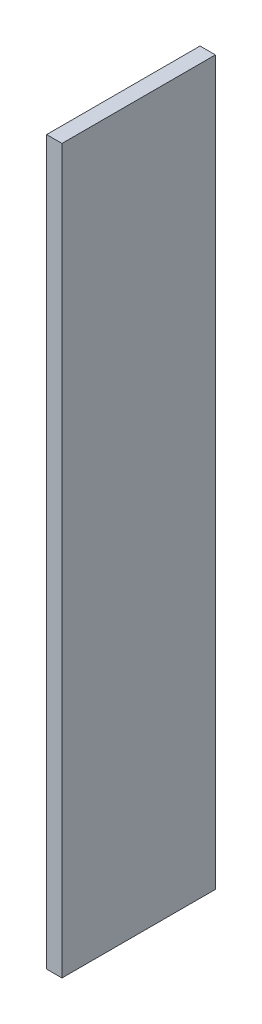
ISO-10303-21;
HEADER;
FILE_DESCRIPTION(('STEP AP214'),'2;1');
FILE_NAME('part.step','',(''),(''),'','','');
FILE_SCHEMA(('AUTOMOTIVE_DESIGN { 1 0 10303 214 1 1 1 1 }'));
ENDSEC;
DATA;
#1=APPLICATION_CONTEXT('core data for automotive mechanical design processes');
#2=APPLICATION_PROTOCOL_DEFINITION('international standard','automotive_design',2000,#1);
#3=PRODUCT_CONTEXT('',#1,'mechanical');
#4=PRODUCT('Part','Part','',(#3));
#5=PRODUCT_RELATED_PRODUCT_CATEGORY('part','',(#4));
#6=PRODUCT_DEFINITION_FORMATION('','',#4);
#7=PRODUCT_DEFINITION_CONTEXT('part definition',#1,'design');
#8=PRODUCT_DEFINITION('design','',#6,#7);
#9=PRODUCT_DEFINITION_SHAPE('','',#8);
#10=(LENGTH_UNIT() NAMED_UNIT(*) SI_UNIT(.MILLI.,.METRE.));
#11=(NAMED_UNIT(*) PLANE_ANGLE_UNIT() SI_UNIT($,.RADIAN.));
#12=(NAMED_UNIT(*) SI_UNIT($,.STERADIAN.) SOLID_ANGLE_UNIT());
#13=UNCERTAINTY_MEASURE_WITH_UNIT(LENGTH_MEASURE(1.E-05),#10,'distance_accuracy_value','');
#14=(GEOMETRIC_REPRESENTATION_CONTEXT(3) GLOBAL_UNCERTAINTY_ASSIGNED_CONTEXT((#13)) GLOBAL_UNIT_ASSIGNED_CONTEXT((#10,
#11,#12)) REPRESENTATION_CONTEXT('',''));
#15=CARTESIAN_POINT('',(0.,0.,0.));
#16=DIRECTION('',(0.,0.,1.));
#17=DIRECTION('',(1.,0.,0.));
#18=AXIS2_PLACEMENT_3D('',#15,#16,#17);
#19=CARTESIAN_POINT('',(35.,235.553999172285,0.));
#20=DIRECTION('',(0.,0.,1.));
#21=DIRECTION('',(1.,0.,0.));
#22=AXIS2_PLACEMENT_3D('',#19,#20,#21);
#23=PLANE('',#22);
#24=DIRECTION('',(1.,0.,0.));
#25=VECTOR('',#24,1.);
#26=CARTESIAN_POINT('',(35.,235.553999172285,0.));
#27=LINE('',#26,#25);
#28=CARTESIAN_POINT('',(35.,235.553999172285,0.));
#29=VERTEX_POINT('',#28);
#30=CARTESIAN_POINT('',(40.,235.553999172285,0.));
#31=VERTEX_POINT('',#30);
#32=EDGE_CURVE('E784',#29,#31,#27,.T.);
#33=ORIENTED_EDGE('',*,*,#32,.T.);
#34=DIRECTION('',(0.,-1.,0.));
#35=VECTOR('',#34,1.);
#36=CARTESIAN_POINT('',(40.,235.553999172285,0.));
#37=LINE('',#36,#35);
#38=CARTESIAN_POINT('',(40.,0.,0.));
#39=VERTEX_POINT('',#38);
#40=EDGE_CURVE('E758',#31,#39,#37,.T.);
#41=ORIENTED_EDGE('',*,*,#40,.T.);
#42=DIRECTION('',(1.,0.,0.));
#43=VECTOR('',#42,1.);
#44=CARTESIAN_POINT('',(35.,0.,0.));
#45=LINE('',#44,#43);
#46=CARTESIAN_POINT('',(35.,0.,0.));
#47=VERTEX_POINT('',#46);
#48=EDGE_CURVE('E370',#47,#39,#45,.T.);
#49=ORIENTED_EDGE('',*,*,#48,.F.);
#50=DIRECTION('',(0.,-1.,0.));
#51=VECTOR('',#50,1.);
#52=CARTESIAN_POINT('',(35.,235.553999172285,0.));
#53=LINE('',#52,#51);
#54=EDGE_CURVE('E775',#29,#47,#53,.T.);
#55=ORIENTED_EDGE('',*,*,#54,.F.);
#56=EDGE_LOOP('',(#33,#41,#49,#55));
#57=FACE_BOUND('',#56,.T.);
#58=ADVANCED_FACE('F363',(#57),#23,.F.);
#59=CARTESIAN_POINT('',(35.,0.,0.));
#60=DIRECTION('',(0.,1.,0.));
#61=DIRECTION('',(-1.,0.,0.));
#62=AXIS2_PLACEMENT_3D('',#59,#60,#61);
#63=PLANE('',#62);
#64=ORIENTED_EDGE('',*,*,#48,.T.);
#65=DIRECTION('',(0.,0.,1.));
#66=VECTOR('',#65,1.);
#67=CARTESIAN_POINT('',(40.,0.,0.));
#68=LINE('',#67,#66);
#69=CARTESIAN_POINT('',(40.,0.,50.));
#70=VERTEX_POINT('',#69);
#71=EDGE_CURVE('E766',#39,#70,#68,.T.);
#72=ORIENTED_EDGE('',*,*,#71,.T.);
#73=DIRECTION('',(1.,0.,0.));
#74=VECTOR('',#73,1.);
#75=CARTESIAN_POINT('',(35.,0.,50.));
#76=LINE('',#75,#74);
#77=CARTESIAN_POINT('',(35.,0.,50.));
#78=VERTEX_POINT('',#77);
#79=EDGE_CURVE('E788',#78,#70,#76,.T.);
#80=ORIENTED_EDGE('',*,*,#79,.F.);
#81=DIRECTION('',(0.,0.,1.));
#82=VECTOR('',#81,1.);
#83=CARTESIAN_POINT('',(35.,0.,0.));
#84=LINE('',#83,#82);
#85=EDGE_CURVE('E778',#47,#78,#84,.T.);
#86=ORIENTED_EDGE('',*,*,#85,.F.);
#87=EDGE_LOOP('',(#64,#72,#80,#86));
#88=FACE_BOUND('',#87,.T.);
#89=ADVANCED_FACE('F792',(#88),#63,.F.);
#90=CARTESIAN_POINT('',(35.,0.,50.));
#91=DIRECTION('',(0.,0.,-1.));
#92=DIRECTION('',(-1.,0.,0.));
#93=AXIS2_PLACEMENT_3D('',#90,#91,#92);
#94=PLANE('',#93);
#95=ORIENTED_EDGE('',*,*,#79,.T.);
#96=DIRECTION('',(0.,1.,0.));
#97=VECTOR('',#96,1.);
#98=CARTESIAN_POINT('',(40.,0.,50.));
#99=LINE('',#98,#97);
#100=CARTESIAN_POINT('',(40.,235.553999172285,50.));
#101=VERTEX_POINT('',#100);
#102=EDGE_CURVE('E769',#70,#101,#99,.T.);
#103=ORIENTED_EDGE('',*,*,#102,.T.);
#104=DIRECTION('',(1.,0.,0.));
#105=VECTOR('',#104,1.);
#106=CARTESIAN_POINT('',(35.,235.553999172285,50.));
#107=LINE('',#106,#105);
#108=CARTESIAN_POINT('',(35.,235.553999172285,50.));
#109=VERTEX_POINT('',#108);
#110=EDGE_CURVE('E786',#109,#101,#107,.T.);
#111=ORIENTED_EDGE('',*,*,#110,.F.);
#112=DIRECTION('',(0.,1.,0.));
#113=VECTOR('',#112,1.);
#114=CARTESIAN_POINT('',(35.,0.,50.));
#115=LINE('',#114,#113);
#116=EDGE_CURVE('E780',#78,#109,#115,.T.);
#117=ORIENTED_EDGE('',*,*,#116,.F.);
#118=EDGE_LOOP('',(#95,#103,#111,#117));
#119=FACE_BOUND('',#118,.T.);
#120=ADVANCED_FACE('F808',(#119),#94,.F.);
#121=CARTESIAN_POINT('',(35.,235.553999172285,50.));
#122=DIRECTION('',(0.,-1.,0.));
#123=DIRECTION('',(1.,0.,0.));
#124=AXIS2_PLACEMENT_3D('',#121,#122,#123);
#125=PLANE('',#124);
#126=ORIENTED_EDGE('',*,*,#110,.T.);
#127=DIRECTION('',(0.,0.,-1.));
#128=VECTOR('',#127,1.);
#129=CARTESIAN_POINT('',(40.,235.553999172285,50.));
#130=LINE('',#129,#128);
#131=EDGE_CURVE('E772',#101,#31,#130,.T.);
#132=ORIENTED_EDGE('',*,*,#131,.T.);
#133=ORIENTED_EDGE('',*,*,#32,.F.);
#134=DIRECTION('',(0.,0.,-1.));
#135=VECTOR('',#134,1.);
#136=CARTESIAN_POINT('',(35.,235.553999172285,50.));
#137=LINE('',#136,#135);
#138=EDGE_CURVE('E782',#109,#29,#137,.T.);
#139=ORIENTED_EDGE('',*,*,#138,.F.);
#140=EDGE_LOOP('',(#126,#132,#133,#139));
#141=FACE_BOUND('',#140,.T.);
#142=ADVANCED_FACE('F804',(#141),#125,.F.);
#143=CARTESIAN_POINT('',(35.,0.,0.));
#144=DIRECTION('',(-1.,0.,0.));
#145=DIRECTION('',(0.,-1.,0.));
#146=AXIS2_PLACEMENT_3D('',#143,#144,#145);
#147=PLANE('',#146);
#148=CARTESIAN_POINT('',(35.,220.831874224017,10.));
#149=DIRECTION('',(-1.,0.,0.));
#150=DIRECTION('',(0.,-1.,0.));
#151=AXIS2_PLACEMENT_3D('',#148,#149,#150);
#152=CIRCLE('',#151,2.5);
#153=CARTESIAN_POINT('',(35.,223.331874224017,10.));
#154=VERTEX_POINT('',#153);
#155=CARTESIAN_POINT('',(35.,218.331874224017,10.));
#156=VERTEX_POINT('',#155);
#157=EDGE_CURVE('E1191',#154,#156,#152,.T.);
#158=ORIENTED_EDGE('',*,*,#157,.F.);
#159=DIRECTION('',(0.,0.,-1.));
#160=VECTOR('',#159,1.);
#161=CARTESIAN_POINT('',(35.,223.331874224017,40.));
#162=LINE('',#161,#160);
#163=CARTESIAN_POINT('',(35.,223.331874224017,40.));
#164=VERTEX_POINT('',#163);
#165=EDGE_CURVE('E619',#164,#154,#162,.T.);
#166=ORIENTED_EDGE('',*,*,#165,.F.);
#167=CARTESIAN_POINT('',(35.,220.831874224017,40.));
#168=DIRECTION('',(-1.,0.,0.));
#169=DIRECTION('',(0.,-1.,0.));
#170=AXIS2_PLACEMENT_3D('',#167,#168,#169);
#171=CIRCLE('',#170,2.5);
#172=CARTESIAN_POINT('',(35.,218.331874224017,40.));
#173=VERTEX_POINT('',#172);
#174=EDGE_CURVE('E1195',#173,#164,#171,.T.);
#175=ORIENTED_EDGE('',*,*,#174,.F.);
#176=DIRECTION('',(0.,0.,1.));
#177=VECTOR('',#176,1.);
#178=CARTESIAN_POINT('',(35.,218.331874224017,10.));
#179=LINE('',#178,#177);
#180=EDGE_CURVE('E613',#156,#173,#179,.T.);
#181=ORIENTED_EDGE('',*,*,#180,.F.);
#182=EDGE_LOOP('',(#158,#166,#175,#181));
#183=FACE_BOUND('',#182,.T.);
#184=CARTESIAN_POINT('',(35.,191.387624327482,10.));
#185=DIRECTION('',(-1.,0.,0.));
#186=DIRECTION('',(0.,-1.,0.));
#187=AXIS2_PLACEMENT_3D('',#184,#185,#186);
#188=CIRCLE('',#187,2.5);
#189=CARTESIAN_POINT('',(35.,193.887624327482,10.));
#190=VERTEX_POINT('',#189);
#191=CARTESIAN_POINT('',(35.,188.887624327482,10.));
#192=VERTEX_POINT('',#191);
#193=EDGE_CURVE('E623',#190,#192,#188,.T.);
#194=ORIENTED_EDGE('',*,*,#193,.F.);
#195=DIRECTION('',(0.,0.,-1.));
#196=VECTOR('',#195,1.);
#197=CARTESIAN_POINT('',(35.,193.887624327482,40.));
#198=LINE('',#197,#196);
#199=CARTESIAN_POINT('',(35.,193.887624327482,40.));
#200=VERTEX_POINT('',#199);
#201=EDGE_CURVE('E632',#200,#190,#198,.T.);
#202=ORIENTED_EDGE('',*,*,#201,.F.);
#203=CARTESIAN_POINT('',(35.,191.387624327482,40.));
#204=DIRECTION('',(-1.,0.,0.));
#205=DIRECTION('',(0.,-1.,0.));
#206=AXIS2_PLACEMENT_3D('',#203,#204,#205);
#207=CIRCLE('',#206,2.5);
#208=CARTESIAN_POINT('',(35.,188.887624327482,40.));
#209=VERTEX_POINT('',#208);
#210=EDGE_CURVE('E629',#209,#200,#207,.T.);
#211=ORIENTED_EDGE('',*,*,#210,.F.);
#212=DIRECTION('',(0.,0.,1.));
#213=VECTOR('',#212,1.);
#214=CARTESIAN_POINT('',(35.,188.887624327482,10.));
#215=LINE('',#214,#213);
#216=EDGE_CURVE('E626',#192,#209,#215,.T.);
#217=ORIENTED_EDGE('',*,*,#216,.F.);
#218=EDGE_LOOP('',(#194,#202,#211,#217));
#219=FACE_BOUND('',#218,.T.);
#220=CARTESIAN_POINT('',(35.,161.943374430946,10.));
#221=DIRECTION('',(-1.,0.,0.));
#222=DIRECTION('',(0.,-1.,0.));
#223=AXIS2_PLACEMENT_3D('',#220,#221,#222);
#224=CIRCLE('',#223,2.5);
#225=CARTESIAN_POINT('',(35.,164.443374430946,10.));
#226=VERTEX_POINT('',#225);
#227=CARTESIAN_POINT('',(35.,159.443374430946,10.));
#228=VERTEX_POINT('',#227);
#229=EDGE_CURVE('E638',#226,#228,#224,.T.);
#230=ORIENTED_EDGE('',*,*,#229,.F.);
#231=DIRECTION('',(0.,0.,-1.));
#232=VECTOR('',#231,1.);
#233=CARTESIAN_POINT('',(35.,164.443374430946,40.));
#234=LINE('',#233,#232);
#235=CARTESIAN_POINT('',(35.,164.443374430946,40.));
#236=VERTEX_POINT('',#235);
#237=EDGE_CURVE('E652',#236,#226,#234,.T.);
#238=ORIENTED_EDGE('',*,*,#237,.F.);
#239=CARTESIAN_POINT('',(35.,161.943374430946,40.));
#240=DIRECTION('',(-1.,0.,0.));
#241=DIRECTION('',(0.,-1.,0.));
#242=AXIS2_PLACEMENT_3D('',#239,#240,#241);
#243=CIRCLE('',#242,2.5);
#244=CARTESIAN_POINT('',(35.,159.443374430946,40.));
#245=VERTEX_POINT('',#244);
#246=EDGE_CURVE('E649',#245,#236,#243,.T.);
#247=ORIENTED_EDGE('',*,*,#246,.F.);
#248=DIRECTION('',(0.,0.,1.));
#249=VECTOR('',#248,1.);
#250=CARTESIAN_POINT('',(35.,159.443374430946,10.));
#251=LINE('',#250,#249);
#252=EDGE_CURVE('E646',#228,#245,#251,.T.);
#253=ORIENTED_EDGE('',*,*,#252,.F.);
#254=EDGE_LOOP('',(#230,#238,#247,#253));
#255=FACE_BOUND('',#254,.T.);
#256=CARTESIAN_POINT('',(35.,132.49912453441,10.));
#257=DIRECTION('',(-1.,0.,0.));
#258=DIRECTION('',(0.,-1.,0.));
#259=AXIS2_PLACEMENT_3D('',#256,#257,#258);
#260=CIRCLE('',#259,2.5);
#261=CARTESIAN_POINT('',(35.,134.99912453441,10.));
#262=VERTEX_POINT('',#261);
#263=CARTESIAN_POINT('',(35.,129.99912453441,10.));
#264=VERTEX_POINT('',#263);
#265=EDGE_CURVE('E658',#262,#264,#260,.T.);
#266=ORIENTED_EDGE('',*,*,#265,.F.);
#267=DIRECTION('',(0.,0.,-1.));
#268=VECTOR('',#267,1.);
#269=CARTESIAN_POINT('',(35.,134.99912453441,40.));
#270=LINE('',#269,#268);
#271=CARTESIAN_POINT('',(35.,134.99912453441,40.));
#272=VERTEX_POINT('',#271);
#273=EDGE_CURVE('E672',#272,#262,#270,.T.);
#274=ORIENTED_EDGE('',*,*,#273,.F.);
#275=CARTESIAN_POINT('',(35.,132.49912453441,40.));
#276=DIRECTION('',(-1.,0.,0.));
#277=DIRECTION('',(0.,-1.,0.));
#278=AXIS2_PLACEMENT_3D('',#275,#276,#277);
#279=CIRCLE('',#278,2.5);
#280=CARTESIAN_POINT('',(35.,129.99912453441,40.));
#281=VERTEX_POINT('',#280);
#282=EDGE_CURVE('E669',#281,#272,#279,.T.);
#283=ORIENTED_EDGE('',*,*,#282,.F.);
#284=DIRECTION('',(0.,0.,1.));
#285=VECTOR('',#284,1.);
#286=CARTESIAN_POINT('',(35.,129.99912453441,10.));
#287=LINE('',#286,#285);
#288=EDGE_CURVE('E666',#264,#281,#287,.T.);
#289=ORIENTED_EDGE('',*,*,#288,.F.);
#290=EDGE_LOOP('',(#266,#274,#283,#289));
#291=FACE_BOUND('',#290,.T.);
#292=CARTESIAN_POINT('',(35.,103.054874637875,10.));
#293=DIRECTION('',(-1.,0.,0.));
#294=DIRECTION('',(0.,-1.,0.));
#295=AXIS2_PLACEMENT_3D('',#292,#293,#294);
#296=CIRCLE('',#295,2.5);
#297=CARTESIAN_POINT('',(35.,105.554874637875,10.));
#298=VERTEX_POINT('',#297);
#299=CARTESIAN_POINT('',(35.,100.554874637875,10.));
#300=VERTEX_POINT('',#299);
#301=EDGE_CURVE('E678',#298,#300,#296,.T.);
#302=ORIENTED_EDGE('',*,*,#301,.F.);
#303=DIRECTION('',(0.,0.,-1.));
#304=VECTOR('',#303,1.);
#305=CARTESIAN_POINT('',(35.,105.554874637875,40.));
#306=LINE('',#305,#304);
#307=CARTESIAN_POINT('',(35.,105.554874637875,40.));
#308=VERTEX_POINT('',#307);
#309=EDGE_CURVE('E692',#308,#298,#306,.T.);
#310=ORIENTED_EDGE('',*,*,#309,.F.);
#311=CARTESIAN_POINT('',(35.,103.054874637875,40.));
#312=DIRECTION('',(-1.,0.,0.));
#313=DIRECTION('',(0.,-1.,0.));
#314=AXIS2_PLACEMENT_3D('',#311,#312,#313);
#315=CIRCLE('',#314,2.5);
#316=CARTESIAN_POINT('',(35.,100.554874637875,40.));
#317=VERTEX_POINT('',#316);
#318=EDGE_CURVE('E689',#317,#308,#315,.T.);
#319=ORIENTED_EDGE('',*,*,#318,.F.);
#320=DIRECTION('',(0.,0.,1.));
#321=VECTOR('',#320,1.);
#322=CARTESIAN_POINT('',(35.,100.554874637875,10.));
#323=LINE('',#322,#321);
#324=EDGE_CURVE('E686',#300,#317,#323,.T.);
#325=ORIENTED_EDGE('',*,*,#324,.F.);
#326=EDGE_LOOP('',(#302,#310,#319,#325));
#327=FACE_BOUND('',#326,.T.);
#328=CARTESIAN_POINT('',(35.,73.6106247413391,10.));
#329=DIRECTION('',(-1.,0.,0.));
#330=DIRECTION('',(0.,-1.,0.));
#331=AXIS2_PLACEMENT_3D('',#328,#329,#330);
#332=CIRCLE('',#331,2.5);
#333=CARTESIAN_POINT('',(35.,76.1106247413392,10.));
#334=VERTEX_POINT('',#333);
#335=CARTESIAN_POINT('',(35.,71.1106247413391,10.));
#336=VERTEX_POINT('',#335);
#337=EDGE_CURVE('E698',#334,#336,#332,.T.);
#338=ORIENTED_EDGE('',*,*,#337,.F.);
#339=DIRECTION('',(0.,0.,-1.));
#340=VECTOR('',#339,1.);
#341=CARTESIAN_POINT('',(35.,76.1106247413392,40.));
#342=LINE('',#341,#340);
#343=CARTESIAN_POINT('',(35.,76.1106247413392,40.));
#344=VERTEX_POINT('',#343);
#345=EDGE_CURVE('E712',#344,#334,#342,.T.);
#346=ORIENTED_EDGE('',*,*,#345,.F.);
#347=CARTESIAN_POINT('',(35.,73.6106247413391,40.));
#348=DIRECTION('',(-1.,0.,0.));
#349=DIRECTION('',(0.,-1.,0.));
#350=AXIS2_PLACEMENT_3D('',#347,#348,#349);
#351=CIRCLE('',#350,2.5);
#352=CARTESIAN_POINT('',(35.,71.1106247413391,40.));
#353=VERTEX_POINT('',#352);
#354=EDGE_CURVE('E709',#353,#344,#351,.T.);
#355=ORIENTED_EDGE('',*,*,#354,.F.);
#356=DIRECTION('',(0.,0.,1.));
#357=VECTOR('',#356,1.);
#358=CARTESIAN_POINT('',(35.,71.1106247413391,10.));
#359=LINE('',#358,#357);
#360=EDGE_CURVE('E706',#336,#353,#359,.T.);
#361=ORIENTED_EDGE('',*,*,#360,.F.);
#362=EDGE_LOOP('',(#338,#346,#355,#361));
#363=FACE_BOUND('',#362,.T.);
#364=CARTESIAN_POINT('',(35.,44.1663748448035,10.));
#365=DIRECTION('',(-1.,0.,0.));
#366=DIRECTION('',(0.,-1.,0.));
#367=AXIS2_PLACEMENT_3D('',#364,#365,#366);
#368=CIRCLE('',#367,2.5);
#369=CARTESIAN_POINT('',(35.,46.6663748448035,10.));
#370=VERTEX_POINT('',#369);
#371=CARTESIAN_POINT('',(35.,41.6663748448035,10.));
#372=VERTEX_POINT('',#371);
#373=EDGE_CURVE('E718',#370,#372,#368,.T.);
#374=ORIENTED_EDGE('',*,*,#373,.F.);
#375=DIRECTION('',(0.,0.,-1.));
#376=VECTOR('',#375,1.);
#377=CARTESIAN_POINT('',(35.,46.6663748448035,40.));
#378=LINE('',#377,#376);
#379=CARTESIAN_POINT('',(35.,46.6663748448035,40.));
#380=VERTEX_POINT('',#379);
#381=EDGE_CURVE('E732',#380,#370,#378,.T.);
#382=ORIENTED_EDGE('',*,*,#381,.F.);
#383=CARTESIAN_POINT('',(35.,44.1663748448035,40.));
#384=DIRECTION('',(-1.,0.,0.));
#385=DIRECTION('',(0.,-1.,0.));
#386=AXIS2_PLACEMENT_3D('',#383,#384,#385);
#387=CIRCLE('',#386,2.5);
#388=CARTESIAN_POINT('',(35.,41.6663748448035,40.));
#389=VERTEX_POINT('',#388);
#390=EDGE_CURVE('E729',#389,#380,#387,.T.);
#391=ORIENTED_EDGE('',*,*,#390,.F.);
#392=DIRECTION('',(0.,0.,1.));
#393=VECTOR('',#392,1.);
#394=CARTESIAN_POINT('',(35.,41.6663748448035,10.));
#395=LINE('',#394,#393);
#396=EDGE_CURVE('E726',#372,#389,#395,.T.);
#397=ORIENTED_EDGE('',*,*,#396,.F.);
#398=EDGE_LOOP('',(#374,#382,#391,#397));
#399=FACE_BOUND('',#398,.T.);
#400=CARTESIAN_POINT('',(35.,14.7221249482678,10.));
#401=DIRECTION('',(-1.,0.,0.));
#402=DIRECTION('',(0.,-1.,0.));
#403=AXIS2_PLACEMENT_3D('',#400,#401,#402);
#404=CIRCLE('',#403,2.5);
#405=CARTESIAN_POINT('',(35.,17.2221249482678,10.));
#406=VERTEX_POINT('',#405);
#407=CARTESIAN_POINT('',(35.,12.2221249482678,10.));
#408=VERTEX_POINT('',#407);
#409=EDGE_CURVE('E738',#406,#408,#404,.T.);
#410=ORIENTED_EDGE('',*,*,#409,.F.);
#411=DIRECTION('',(0.,0.,-1.));
#412=VECTOR('',#411,1.);
#413=CARTESIAN_POINT('',(35.,17.2221249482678,40.));
#414=LINE('',#413,#412);
#415=CARTESIAN_POINT('',(35.,17.2221249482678,40.));
#416=VERTEX_POINT('',#415);
#417=EDGE_CURVE('E752',#416,#406,#414,.T.);
#418=ORIENTED_EDGE('',*,*,#417,.F.);
#419=CARTESIAN_POINT('',(35.,14.7221249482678,40.));
#420=DIRECTION('',(-1.,0.,0.));
#421=DIRECTION('',(0.,-1.,0.));
#422=AXIS2_PLACEMENT_3D('',#419,#420,#421);
#423=CIRCLE('',#422,2.5);
#424=CARTESIAN_POINT('',(35.,12.2221249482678,40.));
#425=VERTEX_POINT('',#424);
#426=EDGE_CURVE('E749',#425,#416,#423,.T.);
#427=ORIENTED_EDGE('',*,*,#426,.F.);
#428=DIRECTION('',(0.,0.,1.));
#429=VECTOR('',#428,1.);
#430=CARTESIAN_POINT('',(35.,12.2221249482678,10.));
#431=LINE('',#430,#429);
#432=EDGE_CURVE('E746',#408,#425,#431,.T.);
#433=ORIENTED_EDGE('',*,*,#432,.F.);
#434=EDGE_LOOP('',(#410,#418,#427,#433));
#435=FACE_BOUND('',#434,.T.);
#436=ORIENTED_EDGE('',*,*,#54,.T.);
#437=ORIENTED_EDGE('',*,*,#85,.T.);
#438=ORIENTED_EDGE('',*,*,#116,.T.);
#439=ORIENTED_EDGE('',*,*,#138,.T.);
#440=EDGE_LOOP('',(#436,#437,#438,#439));
#441=FACE_BOUND('',#440,.T.);
#442=ADVANCED_FACE('F810',(#183,#219,#255,#291,#327,#363,#399,#435,#441),#147,.T.);
#443=CARTESIAN_POINT('',(40.,0.,0.));
#444=DIRECTION('',(-1.,0.,0.));
#445=DIRECTION('',(0.,-1.,0.));
#446=AXIS2_PLACEMENT_3D('',#443,#444,#445);
#447=PLANE('',#446);
#448=ORIENTED_EDGE('',*,*,#40,.F.);
#449=ORIENTED_EDGE('',*,*,#131,.F.);
#450=ORIENTED_EDGE('',*,*,#102,.F.);
#451=ORIENTED_EDGE('',*,*,#71,.F.);
#452=EDGE_LOOP('',(#448,#449,#450,#451));
#453=FACE_BOUND('',#452,.T.);
#454=ADVANCED_FACE('F799',(#453),#447,.F.);
#455=CARTESIAN_POINT('',(40.,14.7221249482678,10.));
#456=DIRECTION('',(-1.,0.,0.));
#457=DIRECTION('',(0.,-1.,0.));
#458=AXIS2_PLACEMENT_3D('',#455,#456,#457);
#459=CYLINDRICAL_SURFACE('',#458,2.5);
#460=DIRECTION('',(-1.,0.,0.));
#461=VECTOR('',#460,1.);
#462=CARTESIAN_POINT('',(40.,12.2221249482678,10.));
#463=LINE('',#462,#461);
#464=CARTESIAN_POINT('',(36.,12.2221249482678,10.));
#465=VERTEX_POINT('',#464);
#466=EDGE_CURVE('E755',#465,#408,#463,.T.);
#467=ORIENTED_EDGE('',*,*,#466,.F.);
#468=CARTESIAN_POINT('',(36.,14.7221249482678,10.));
#469=DIRECTION('',(-1.,0.,0.));
#470=DIRECTION('',(0.,0.,1.));
#471=AXIS2_PLACEMENT_3D('',#468,#469,#470);
#472=CIRCLE('',#471,2.5);
#473=CARTESIAN_POINT('',(36.,17.2221249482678,10.));
#474=VERTEX_POINT('',#473);
#475=EDGE_CURVE('E377',#465,#474,#472,.F.);
#476=ORIENTED_EDGE('',*,*,#475,.T.);
#477=DIRECTION('',(-1.,0.,0.));
#478=VECTOR('',#477,1.);
#479=CARTESIAN_POINT('',(40.,17.2221249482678,10.));
#480=LINE('',#479,#478);
#481=EDGE_CURVE('E756',#474,#406,#480,.T.);
#482=ORIENTED_EDGE('',*,*,#481,.T.);
#483=ORIENTED_EDGE('',*,*,#409,.T.);
#484=EDGE_LOOP('',(#467,#476,#482,#483));
#485=FACE_BOUND('',#484,.T.);
#486=ADVANCED_FACE('F818',(#485),#459,.F.);
#487=CARTESIAN_POINT('',(40.,17.2221249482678,40.));
#488=DIRECTION('',(0.,1.,0.));
#489=DIRECTION('',(0.,0.,1.));
#490=AXIS2_PLACEMENT_3D('',#487,#488,#489);
#491=PLANE('',#490);
#492=ORIENTED_EDGE('',*,*,#481,.F.);
#493=DIRECTION('',(0.,0.,1.));
#494=VECTOR('',#493,1.);
#495=CARTESIAN_POINT('',(36.,17.2221249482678,40.));
#496=LINE('',#495,#494);
#497=CARTESIAN_POINT('',(36.,17.2221249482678,40.));
#498=VERTEX_POINT('',#497);
#499=EDGE_CURVE('E1187',#474,#498,#496,.T.);
#500=ORIENTED_EDGE('',*,*,#499,.T.);
#501=DIRECTION('',(-1.,0.,0.));
#502=VECTOR('',#501,1.);
#503=CARTESIAN_POINT('',(40.,17.2221249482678,40.));
#504=LINE('',#503,#502);
#505=EDGE_CURVE('E759',#498,#416,#504,.T.);
#506=ORIENTED_EDGE('',*,*,#505,.T.);
#507=ORIENTED_EDGE('',*,*,#417,.T.);
#508=EDGE_LOOP('',(#492,#500,#506,#507));
#509=FACE_BOUND('',#508,.T.);
#510=ADVANCED_FACE('F850',(#509),#491,.F.);
#511=CARTESIAN_POINT('',(40.,14.7221249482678,40.));
#512=DIRECTION('',(-1.,0.,0.));
#513=DIRECTION('',(0.,-1.,0.));
#514=AXIS2_PLACEMENT_3D('',#511,#512,#513);
#515=CYLINDRICAL_SURFACE('',#514,2.5);
#516=ORIENTED_EDGE('',*,*,#505,.F.);
#517=CARTESIAN_POINT('',(36.,14.7221249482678,40.));
#518=DIRECTION('',(-1.,0.,0.));
#519=DIRECTION('',(0.,0.,1.));
#520=AXIS2_PLACEMENT_3D('',#517,#518,#519);
#521=CIRCLE('',#520,2.5);
#522=CARTESIAN_POINT('',(36.,12.2221249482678,40.));
#523=VERTEX_POINT('',#522);
#524=EDGE_CURVE('E1184',#498,#523,#521,.F.);
#525=ORIENTED_EDGE('',*,*,#524,.T.);
#526=DIRECTION('',(-1.,0.,0.));
#527=VECTOR('',#526,1.);
#528=CARTESIAN_POINT('',(40.,12.2221249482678,40.));
#529=LINE('',#528,#527);
#530=EDGE_CURVE('E761',#523,#425,#529,.T.);
#531=ORIENTED_EDGE('',*,*,#530,.T.);
#532=ORIENTED_EDGE('',*,*,#426,.T.);
#533=EDGE_LOOP('',(#516,#525,#531,#532));
#534=FACE_BOUND('',#533,.T.);
#535=ADVANCED_FACE('F858',(#534),#515,.F.);
#536=CARTESIAN_POINT('',(40.,12.2221249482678,10.));
#537=DIRECTION('',(0.,-1.,0.));
#538=DIRECTION('',(1.,0.,0.));
#539=AXIS2_PLACEMENT_3D('',#536,#537,#538);
#540=PLANE('',#539);
#541=ORIENTED_EDGE('',*,*,#530,.F.);
#542=DIRECTION('',(0.,0.,-1.));
#543=VECTOR('',#542,1.);
#544=CARTESIAN_POINT('',(36.,12.2221249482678,10.));
#545=LINE('',#544,#543);
#546=EDGE_CURVE('E1182',#523,#465,#545,.T.);
#547=ORIENTED_EDGE('',*,*,#546,.T.);
#548=ORIENTED_EDGE('',*,*,#466,.T.);
#549=ORIENTED_EDGE('',*,*,#432,.T.);
#550=EDGE_LOOP('',(#541,#547,#548,#549));
#551=FACE_BOUND('',#550,.T.);
#552=ADVANCED_FACE('F866',(#551),#540,.F.);
#553=CARTESIAN_POINT('',(40.,44.1663748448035,10.));
#554=DIRECTION('',(-1.,0.,0.));
#555=DIRECTION('',(0.,-1.,0.));
#556=AXIS2_PLACEMENT_3D('',#553,#554,#555);
#557=CYLINDRICAL_SURFACE('',#556,2.5);
#558=DIRECTION('',(-1.,0.,0.));
#559=VECTOR('',#558,1.);
#560=CARTESIAN_POINT('',(40.,41.6663748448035,10.));
#561=LINE('',#560,#559);
#562=CARTESIAN_POINT('',(36.,41.6663748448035,10.));
#563=VERTEX_POINT('',#562);
#564=EDGE_CURVE('E735',#563,#372,#561,.T.);
#565=ORIENTED_EDGE('',*,*,#564,.F.);
#566=CARTESIAN_POINT('',(36.,44.1663748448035,10.));
#567=DIRECTION('',(-1.,0.,0.));
#568=DIRECTION('',(0.,0.,1.));
#569=AXIS2_PLACEMENT_3D('',#566,#567,#568);
#570=CIRCLE('',#569,2.5);
#571=CARTESIAN_POINT('',(36.,46.6663748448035,10.));
#572=VERTEX_POINT('',#571);
#573=EDGE_CURVE('E385',#563,#572,#570,.F.);
#574=ORIENTED_EDGE('',*,*,#573,.T.);
#575=DIRECTION('',(-1.,0.,0.));
#576=VECTOR('',#575,1.);
#577=CARTESIAN_POINT('',(40.,46.6663748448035,10.));
#578=LINE('',#577,#576);
#579=EDGE_CURVE('E736',#572,#370,#578,.T.);
#580=ORIENTED_EDGE('',*,*,#579,.T.);
#581=ORIENTED_EDGE('',*,*,#373,.T.);
#582=EDGE_LOOP('',(#565,#574,#580,#581));
#583=FACE_BOUND('',#582,.T.);
#584=ADVANCED_FACE('F874',(#583),#557,.F.);
#585=CARTESIAN_POINT('',(40.,46.6663748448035,40.));
#586=DIRECTION('',(0.,1.,0.));
#587=DIRECTION('',(-1.,0.,0.));
#588=AXIS2_PLACEMENT_3D('',#585,#586,#587);
#589=PLANE('',#588);
#590=ORIENTED_EDGE('',*,*,#579,.F.);
#591=DIRECTION('',(0.,0.,1.));
#592=VECTOR('',#591,1.);
#593=CARTESIAN_POINT('',(36.,46.6663748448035,40.));
#594=LINE('',#593,#592);
#595=CARTESIAN_POINT('',(36.,46.6663748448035,40.));
#596=VERTEX_POINT('',#595);
#597=EDGE_CURVE('E1178',#572,#596,#594,.T.);
#598=ORIENTED_EDGE('',*,*,#597,.T.);
#599=DIRECTION('',(-1.,0.,0.));
#600=VECTOR('',#599,1.);
#601=CARTESIAN_POINT('',(40.,46.6663748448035,40.));
#602=LINE('',#601,#600);
#603=EDGE_CURVE('E739',#596,#380,#602,.T.);
#604=ORIENTED_EDGE('',*,*,#603,.T.);
#605=ORIENTED_EDGE('',*,*,#381,.T.);
#606=EDGE_LOOP('',(#590,#598,#604,#605));
#607=FACE_BOUND('',#606,.T.);
#608=ADVANCED_FACE('F882',(#607),#589,.F.);
#609=CARTESIAN_POINT('',(40.,44.1663748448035,40.));
#610=DIRECTION('',(-1.,0.,0.));
#611=DIRECTION('',(0.,-1.,0.));
#612=AXIS2_PLACEMENT_3D('',#609,#610,#611);
#613=CYLINDRICAL_SURFACE('',#612,2.5);
#614=ORIENTED_EDGE('',*,*,#603,.F.);
#615=CARTESIAN_POINT('',(36.,44.1663748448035,40.));
#616=DIRECTION('',(-1.,0.,0.));
#617=DIRECTION('',(0.,0.,1.));
#618=AXIS2_PLACEMENT_3D('',#615,#616,#617);
#619=CIRCLE('',#618,2.5);
#620=CARTESIAN_POINT('',(36.,41.6663748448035,40.));
#621=VERTEX_POINT('',#620);
#622=EDGE_CURVE('E1175',#596,#621,#619,.F.);
#623=ORIENTED_EDGE('',*,*,#622,.T.);
#624=DIRECTION('',(-1.,0.,0.));
#625=VECTOR('',#624,1.);
#626=CARTESIAN_POINT('',(40.,41.6663748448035,40.));
#627=LINE('',#626,#625);
#628=EDGE_CURVE('E741',#621,#389,#627,.T.);
#629=ORIENTED_EDGE('',*,*,#628,.T.);
#630=ORIENTED_EDGE('',*,*,#390,.T.);
#631=EDGE_LOOP('',(#614,#623,#629,#630));
#632=FACE_BOUND('',#631,.T.);
#633=ADVANCED_FACE('F890',(#632),#613,.F.);
#634=CARTESIAN_POINT('',(40.,41.6663748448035,10.));
#635=DIRECTION('',(0.,-1.,0.));
#636=DIRECTION('',(1.,0.,0.));
#637=AXIS2_PLACEMENT_3D('',#634,#635,#636);
#638=PLANE('',#637);
#639=ORIENTED_EDGE('',*,*,#628,.F.);
#640=DIRECTION('',(0.,0.,-1.));
#641=VECTOR('',#640,1.);
#642=CARTESIAN_POINT('',(36.,41.6663748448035,10.));
#643=LINE('',#642,#641);
#644=EDGE_CURVE('E1157',#621,#563,#643,.T.);
#645=ORIENTED_EDGE('',*,*,#644,.T.);
#646=ORIENTED_EDGE('',*,*,#564,.T.);
#647=ORIENTED_EDGE('',*,*,#396,.T.);
#648=EDGE_LOOP('',(#639,#645,#646,#647));
#649=FACE_BOUND('',#648,.T.);
#650=ADVANCED_FACE('F898',(#649),#638,.F.);
#651=CARTESIAN_POINT('',(40.,73.6106247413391,10.));
#652=DIRECTION('',(-1.,0.,0.));
#653=DIRECTION('',(0.,-1.,0.));
#654=AXIS2_PLACEMENT_3D('',#651,#652,#653);
#655=CYLINDRICAL_SURFACE('',#654,2.5);
#656=DIRECTION('',(-1.,0.,0.));
#657=VECTOR('',#656,1.);
#658=CARTESIAN_POINT('',(40.,71.1106247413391,10.));
#659=LINE('',#658,#657);
#660=CARTESIAN_POINT('',(36.,71.1106247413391,10.));
#661=VERTEX_POINT('',#660);
#662=EDGE_CURVE('E715',#661,#336,#659,.T.);
#663=ORIENTED_EDGE('',*,*,#662,.F.);
#664=CARTESIAN_POINT('',(36.,73.6106247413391,10.));
#665=DIRECTION('',(-1.,0.,0.));
#666=DIRECTION('',(0.,0.,1.));
#667=AXIS2_PLACEMENT_3D('',#664,#665,#666);
#668=CIRCLE('',#667,2.5);
#669=CARTESIAN_POINT('',(36.,76.1106247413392,10.));
#670=VERTEX_POINT('',#669);
#671=EDGE_CURVE('E1149',#661,#670,#668,.F.);
#672=ORIENTED_EDGE('',*,*,#671,.T.);
#673=DIRECTION('',(-1.,0.,0.));
#674=VECTOR('',#673,1.);
#675=CARTESIAN_POINT('',(40.,76.1106247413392,10.));
#676=LINE('',#675,#674);
#677=EDGE_CURVE('E716',#670,#334,#676,.T.);
#678=ORIENTED_EDGE('',*,*,#677,.T.);
#679=ORIENTED_EDGE('',*,*,#337,.T.);
#680=EDGE_LOOP('',(#663,#672,#678,#679));
#681=FACE_BOUND('',#680,.T.);
#682=ADVANCED_FACE('F906',(#681),#655,.F.);
#683=CARTESIAN_POINT('',(40.,76.1106247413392,40.));
#684=DIRECTION('',(0.,1.,0.));
#685=DIRECTION('',(-1.,0.,0.));
#686=AXIS2_PLACEMENT_3D('',#683,#684,#685);
#687=PLANE('',#686);
#688=ORIENTED_EDGE('',*,*,#677,.F.);
#689=DIRECTION('',(0.,0.,1.));
#690=VECTOR('',#689,1.);
#691=CARTESIAN_POINT('',(36.,76.1106247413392,40.));
#692=LINE('',#691,#690);
#693=CARTESIAN_POINT('',(36.,76.1106247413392,40.));
#694=VERTEX_POINT('',#693);
#695=EDGE_CURVE('E1154',#670,#694,#692,.T.);
#696=ORIENTED_EDGE('',*,*,#695,.T.);
#697=DIRECTION('',(-1.,0.,0.));
#698=VECTOR('',#697,1.);
#699=CARTESIAN_POINT('',(40.,76.1106247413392,40.));
#700=LINE('',#699,#698);
#701=EDGE_CURVE('E719',#694,#344,#700,.T.);
#702=ORIENTED_EDGE('',*,*,#701,.T.);
#703=ORIENTED_EDGE('',*,*,#345,.T.);
#704=EDGE_LOOP('',(#688,#696,#702,#703));
#705=FACE_BOUND('',#704,.T.);
#706=ADVANCED_FACE('F914',(#705),#687,.F.);
#707=CARTESIAN_POINT('',(40.,73.6106247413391,40.));
#708=DIRECTION('',(-1.,0.,0.));
#709=DIRECTION('',(0.,-1.,0.));
#710=AXIS2_PLACEMENT_3D('',#707,#708,#709);
#711=CYLINDRICAL_SURFACE('',#710,2.5);
#712=ORIENTED_EDGE('',*,*,#701,.F.);
#713=CARTESIAN_POINT('',(36.,73.6106247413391,40.));
#714=DIRECTION('',(-1.,0.,0.));
#715=DIRECTION('',(0.,0.,1.));
#716=AXIS2_PLACEMENT_3D('',#713,#714,#715);
#717=CIRCLE('',#716,2.5);
#718=CARTESIAN_POINT('',(36.,71.1106247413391,40.));
#719=VERTEX_POINT('',#718);
#720=EDGE_CURVE('E1160',#694,#719,#717,.F.);
#721=ORIENTED_EDGE('',*,*,#720,.T.);
#722=DIRECTION('',(-1.,0.,0.));
#723=VECTOR('',#722,1.);
#724=CARTESIAN_POINT('',(40.,71.1106247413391,40.));
#725=LINE('',#724,#723);
#726=EDGE_CURVE('E721',#719,#353,#725,.T.);
#727=ORIENTED_EDGE('',*,*,#726,.T.);
#728=ORIENTED_EDGE('',*,*,#354,.T.);
#729=EDGE_LOOP('',(#712,#721,#727,#728));
#730=FACE_BOUND('',#729,.T.);
#731=ADVANCED_FACE('F922',(#730),#711,.F.);
#732=CARTESIAN_POINT('',(40.,71.1106247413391,10.));
#733=DIRECTION('',(0.,-1.,0.));
#734=DIRECTION('',(1.,0.,0.));
#735=AXIS2_PLACEMENT_3D('',#732,#733,#734);
#736=PLANE('',#735);
#737=ORIENTED_EDGE('',*,*,#726,.F.);
#738=DIRECTION('',(0.,0.,-1.));
#739=VECTOR('',#738,1.);
#740=CARTESIAN_POINT('',(36.,71.1106247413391,10.));
#741=LINE('',#740,#739);
#742=EDGE_CURVE('E1151',#719,#661,#741,.T.);
#743=ORIENTED_EDGE('',*,*,#742,.T.);
#744=ORIENTED_EDGE('',*,*,#662,.T.);
#745=ORIENTED_EDGE('',*,*,#360,.T.);
#746=EDGE_LOOP('',(#737,#743,#744,#745));
#747=FACE_BOUND('',#746,.T.);
#748=ADVANCED_FACE('F930',(#747),#736,.F.);
#749=CARTESIAN_POINT('',(40.,103.054874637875,10.));
#750=DIRECTION('',(-1.,0.,0.));
#751=DIRECTION('',(0.,-1.,0.));
#752=AXIS2_PLACEMENT_3D('',#749,#750,#751);
#753=CYLINDRICAL_SURFACE('',#752,2.5);
#754=DIRECTION('',(-1.,0.,0.));
#755=VECTOR('',#754,1.);
#756=CARTESIAN_POINT('',(40.,100.554874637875,10.));
#757=LINE('',#756,#755);
#758=CARTESIAN_POINT('',(36.,100.554874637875,10.));
#759=VERTEX_POINT('',#758);
#760=EDGE_CURVE('E695',#759,#300,#757,.T.);
#761=ORIENTED_EDGE('',*,*,#760,.F.);
#762=CARTESIAN_POINT('',(36.,103.054874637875,10.));
#763=DIRECTION('',(-1.,0.,0.));
#764=DIRECTION('',(0.,0.,1.));
#765=AXIS2_PLACEMENT_3D('',#762,#763,#764);
#766=CIRCLE('',#765,2.5);
#767=CARTESIAN_POINT('',(36.,105.554874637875,10.));
#768=VERTEX_POINT('',#767);
#769=EDGE_CURVE('E1161',#759,#768,#766,.F.);
#770=ORIENTED_EDGE('',*,*,#769,.T.);
#771=DIRECTION('',(-1.,0.,0.));
#772=VECTOR('',#771,1.);
#773=CARTESIAN_POINT('',(40.,105.554874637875,10.));
#774=LINE('',#773,#772);
#775=EDGE_CURVE('E696',#768,#298,#774,.T.);
#776=ORIENTED_EDGE('',*,*,#775,.T.);
#777=ORIENTED_EDGE('',*,*,#301,.T.);
#778=EDGE_LOOP('',(#761,#770,#776,#777));
#779=FACE_BOUND('',#778,.T.);
#780=ADVANCED_FACE('F938',(#779),#753,.F.);
#781=CARTESIAN_POINT('',(40.,105.554874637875,40.));
#782=DIRECTION('',(0.,1.,0.));
#783=DIRECTION('',(-1.,0.,0.));
#784=AXIS2_PLACEMENT_3D('',#781,#782,#783);
#785=PLANE('',#784);
#786=ORIENTED_EDGE('',*,*,#775,.F.);
#787=DIRECTION('',(0.,0.,1.));
#788=VECTOR('',#787,1.);
#789=CARTESIAN_POINT('',(36.,105.554874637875,40.));
#790=LINE('',#789,#788);
#791=CARTESIAN_POINT('',(36.,105.554874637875,40.));
#792=VERTEX_POINT('',#791);
#793=EDGE_CURVE('E1245',#768,#792,#790,.T.);
#794=ORIENTED_EDGE('',*,*,#793,.T.);
#795=DIRECTION('',(-1.,0.,0.));
#796=VECTOR('',#795,1.);
#797=CARTESIAN_POINT('',(40.,105.554874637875,40.));
#798=LINE('',#797,#796);
#799=EDGE_CURVE('E699',#792,#308,#798,.T.);
#800=ORIENTED_EDGE('',*,*,#799,.T.);
#801=ORIENTED_EDGE('',*,*,#309,.T.);
#802=EDGE_LOOP('',(#786,#794,#800,#801));
#803=FACE_BOUND('',#802,.T.);
#804=ADVANCED_FACE('F946',(#803),#785,.F.);
#805=CARTESIAN_POINT('',(40.,103.054874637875,40.));
#806=DIRECTION('',(-1.,0.,0.));
#807=DIRECTION('',(0.,-1.,0.));
#808=AXIS2_PLACEMENT_3D('',#805,#806,#807);
#809=CYLINDRICAL_SURFACE('',#808,2.5);
#810=ORIENTED_EDGE('',*,*,#799,.F.);
#811=CARTESIAN_POINT('',(36.,103.054874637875,40.));
#812=DIRECTION('',(-1.,0.,0.));
#813=DIRECTION('',(0.,0.,1.));
#814=AXIS2_PLACEMENT_3D('',#811,#812,#813);
#815=CIRCLE('',#814,2.5);
#816=CARTESIAN_POINT('',(36.,100.554874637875,40.));
#817=VERTEX_POINT('',#816);
#818=EDGE_CURVE('E1242',#792,#817,#815,.F.);
#819=ORIENTED_EDGE('',*,*,#818,.T.);
#820=DIRECTION('',(-1.,0.,0.));
#821=VECTOR('',#820,1.);
#822=CARTESIAN_POINT('',(40.,100.554874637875,40.));
#823=LINE('',#822,#821);
#824=EDGE_CURVE('E701',#817,#317,#823,.T.);
#825=ORIENTED_EDGE('',*,*,#824,.T.);
#826=ORIENTED_EDGE('',*,*,#318,.T.);
#827=EDGE_LOOP('',(#810,#819,#825,#826));
#828=FACE_BOUND('',#827,.T.);
#829=ADVANCED_FACE('F954',(#828),#809,.F.);
#830=CARTESIAN_POINT('',(40.,100.554874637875,10.));
#831=DIRECTION('',(0.,-1.,0.));
#832=DIRECTION('',(1.,0.,0.));
#833=AXIS2_PLACEMENT_3D('',#830,#831,#832);
#834=PLANE('',#833);
#835=ORIENTED_EDGE('',*,*,#824,.F.);
#836=DIRECTION('',(0.,0.,-1.));
#837=VECTOR('',#836,1.);
#838=CARTESIAN_POINT('',(36.,100.554874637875,10.));
#839=LINE('',#838,#837);
#840=EDGE_CURVE('E1239',#817,#759,#839,.T.);
#841=ORIENTED_EDGE('',*,*,#840,.T.);
#842=ORIENTED_EDGE('',*,*,#760,.T.);
#843=ORIENTED_EDGE('',*,*,#324,.T.);
#844=EDGE_LOOP('',(#835,#841,#842,#843));
#845=FACE_BOUND('',#844,.T.);
#846=ADVANCED_FACE('F962',(#845),#834,.F.);
#847=CARTESIAN_POINT('',(40.,132.49912453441,10.));
#848=DIRECTION('',(-1.,0.,0.));
#849=DIRECTION('',(0.,-1.,0.));
#850=AXIS2_PLACEMENT_3D('',#847,#848,#849);
#851=CYLINDRICAL_SURFACE('',#850,2.5);
#852=DIRECTION('',(-1.,0.,0.));
#853=VECTOR('',#852,1.);
#854=CARTESIAN_POINT('',(40.,129.99912453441,10.));
#855=LINE('',#854,#853);
#856=CARTESIAN_POINT('',(36.,129.99912453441,10.));
#857=VERTEX_POINT('',#856);
#858=EDGE_CURVE('E675',#857,#264,#855,.T.);
#859=ORIENTED_EDGE('',*,*,#858,.F.);
#860=CARTESIAN_POINT('',(36.,132.49912453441,10.));
#861=DIRECTION('',(-1.,0.,0.));
#862=DIRECTION('',(0.,0.,1.));
#863=AXIS2_PLACEMENT_3D('',#860,#861,#862);
#864=CIRCLE('',#863,2.5);
#865=CARTESIAN_POINT('',(36.,134.99912453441,10.));
#866=VERTEX_POINT('',#865);
#867=EDGE_CURVE('E1236',#857,#866,#864,.F.);
#868=ORIENTED_EDGE('',*,*,#867,.T.);
#869=DIRECTION('',(-1.,0.,0.));
#870=VECTOR('',#869,1.);
#871=CARTESIAN_POINT('',(40.,134.99912453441,10.));
#872=LINE('',#871,#870);
#873=EDGE_CURVE('E676',#866,#262,#872,.T.);
#874=ORIENTED_EDGE('',*,*,#873,.T.);
#875=ORIENTED_EDGE('',*,*,#265,.T.);
#876=EDGE_LOOP('',(#859,#868,#874,#875));
#877=FACE_BOUND('',#876,.T.);
#878=ADVANCED_FACE('F970',(#877),#851,.F.);
#879=CARTESIAN_POINT('',(40.,134.99912453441,40.));
#880=DIRECTION('',(0.,1.,0.));
#881=DIRECTION('',(-1.,0.,0.));
#882=AXIS2_PLACEMENT_3D('',#879,#880,#881);
#883=PLANE('',#882);
#884=ORIENTED_EDGE('',*,*,#873,.F.);
#885=DIRECTION('',(0.,0.,1.));
#886=VECTOR('',#885,1.);
#887=CARTESIAN_POINT('',(36.,134.99912453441,40.));
#888=LINE('',#887,#886);
#889=CARTESIAN_POINT('',(36.,134.99912453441,40.));
#890=VERTEX_POINT('',#889);
#891=EDGE_CURVE('E1233',#866,#890,#888,.T.);
#892=ORIENTED_EDGE('',*,*,#891,.T.);
#893=DIRECTION('',(-1.,0.,0.));
#894=VECTOR('',#893,1.);
#895=CARTESIAN_POINT('',(40.,134.99912453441,40.));
#896=LINE('',#895,#894);
#897=EDGE_CURVE('E679',#890,#272,#896,.T.);
#898=ORIENTED_EDGE('',*,*,#897,.T.);
#899=ORIENTED_EDGE('',*,*,#273,.T.);
#900=EDGE_LOOP('',(#884,#892,#898,#899));
#901=FACE_BOUND('',#900,.T.);
#902=ADVANCED_FACE('F978',(#901),#883,.F.);
#903=CARTESIAN_POINT('',(40.,132.49912453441,40.));
#904=DIRECTION('',(-1.,0.,0.));
#905=DIRECTION('',(0.,-1.,0.));
#906=AXIS2_PLACEMENT_3D('',#903,#904,#905);
#907=CYLINDRICAL_SURFACE('',#906,2.5);
#908=ORIENTED_EDGE('',*,*,#897,.F.);
#909=CARTESIAN_POINT('',(36.,132.49912453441,40.));
#910=DIRECTION('',(-1.,0.,0.));
#911=DIRECTION('',(0.,0.,1.));
#912=AXIS2_PLACEMENT_3D('',#909,#910,#911);
#913=CIRCLE('',#912,2.5);
#914=CARTESIAN_POINT('',(36.,129.99912453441,40.));
#915=VERTEX_POINT('',#914);
#916=EDGE_CURVE('E1230',#890,#915,#913,.F.);
#917=ORIENTED_EDGE('',*,*,#916,.T.);
#918=DIRECTION('',(-1.,0.,0.));
#919=VECTOR('',#918,1.);
#920=CARTESIAN_POINT('',(40.,129.99912453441,40.));
#921=LINE('',#920,#919);
#922=EDGE_CURVE('E681',#915,#281,#921,.T.);
#923=ORIENTED_EDGE('',*,*,#922,.T.);
#924=ORIENTED_EDGE('',*,*,#282,.T.);
#925=EDGE_LOOP('',(#908,#917,#923,#924));
#926=FACE_BOUND('',#925,.T.);
#927=ADVANCED_FACE('F986',(#926),#907,.F.);
#928=CARTESIAN_POINT('',(40.,129.99912453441,10.));
#929=DIRECTION('',(0.,-1.,0.));
#930=DIRECTION('',(1.,0.,0.));
#931=AXIS2_PLACEMENT_3D('',#928,#929,#930);
#932=PLANE('',#931);
#933=ORIENTED_EDGE('',*,*,#922,.F.);
#934=DIRECTION('',(0.,0.,-1.));
#935=VECTOR('',#934,1.);
#936=CARTESIAN_POINT('',(36.,129.99912453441,10.));
#937=LINE('',#936,#935);
#938=EDGE_CURVE('E1227',#915,#857,#937,.T.);
#939=ORIENTED_EDGE('',*,*,#938,.T.);
#940=ORIENTED_EDGE('',*,*,#858,.T.);
#941=ORIENTED_EDGE('',*,*,#288,.T.);
#942=EDGE_LOOP('',(#933,#939,#940,#941));
#943=FACE_BOUND('',#942,.T.);
#944=ADVANCED_FACE('F994',(#943),#932,.F.);
#945=CARTESIAN_POINT('',(40.,161.943374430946,10.));
#946=DIRECTION('',(-1.,0.,0.));
#947=DIRECTION('',(0.,-1.,0.));
#948=AXIS2_PLACEMENT_3D('',#945,#946,#947);
#949=CYLINDRICAL_SURFACE('',#948,2.5);
#950=DIRECTION('',(-1.,0.,0.));
#951=VECTOR('',#950,1.);
#952=CARTESIAN_POINT('',(40.,159.443374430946,10.));
#953=LINE('',#952,#951);
#954=CARTESIAN_POINT('',(36.,159.443374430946,10.));
#955=VERTEX_POINT('',#954);
#956=EDGE_CURVE('E655',#955,#228,#953,.T.);
#957=ORIENTED_EDGE('',*,*,#956,.F.);
#958=CARTESIAN_POINT('',(36.,161.943374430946,10.));
#959=DIRECTION('',(-1.,0.,0.));
#960=DIRECTION('',(0.,0.,1.));
#961=AXIS2_PLACEMENT_3D('',#958,#959,#960);
#962=CIRCLE('',#961,2.5);
#963=CARTESIAN_POINT('',(36.,164.443374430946,10.));
#964=VERTEX_POINT('',#963);
#965=EDGE_CURVE('E1224',#955,#964,#962,.F.);
#966=ORIENTED_EDGE('',*,*,#965,.T.);
#967=DIRECTION('',(-1.,0.,0.));
#968=VECTOR('',#967,1.);
#969=CARTESIAN_POINT('',(40.,164.443374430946,10.));
#970=LINE('',#969,#968);
#971=EDGE_CURVE('E656',#964,#226,#970,.T.);
#972=ORIENTED_EDGE('',*,*,#971,.T.);
#973=ORIENTED_EDGE('',*,*,#229,.T.);
#974=EDGE_LOOP('',(#957,#966,#972,#973));
#975=FACE_BOUND('',#974,.T.);
#976=ADVANCED_FACE('F1002',(#975),#949,.F.);
#977=CARTESIAN_POINT('',(40.,164.443374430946,40.));
#978=DIRECTION('',(0.,1.,0.));
#979=DIRECTION('',(-1.,0.,0.));
#980=AXIS2_PLACEMENT_3D('',#977,#978,#979);
#981=PLANE('',#980);
#982=ORIENTED_EDGE('',*,*,#971,.F.);
#983=DIRECTION('',(0.,0.,1.));
#984=VECTOR('',#983,1.);
#985=CARTESIAN_POINT('',(36.,164.443374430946,40.));
#986=LINE('',#985,#984);
#987=CARTESIAN_POINT('',(36.,164.443374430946,40.));
#988=VERTEX_POINT('',#987);
#989=EDGE_CURVE('E1221',#964,#988,#986,.T.);
#990=ORIENTED_EDGE('',*,*,#989,.T.);
#991=DIRECTION('',(-1.,0.,0.));
#992=VECTOR('',#991,1.);
#993=CARTESIAN_POINT('',(40.,164.443374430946,40.));
#994=LINE('',#993,#992);
#995=EDGE_CURVE('E659',#988,#236,#994,.T.);
#996=ORIENTED_EDGE('',*,*,#995,.T.);
#997=ORIENTED_EDGE('',*,*,#237,.T.);
#998=EDGE_LOOP('',(#982,#990,#996,#997));
#999=FACE_BOUND('',#998,.T.);
#1000=ADVANCED_FACE('F1010',(#999),#981,.F.);
#1001=CARTESIAN_POINT('',(40.,161.943374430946,40.));
#1002=DIRECTION('',(-1.,0.,0.));
#1003=DIRECTION('',(0.,-1.,0.));
#1004=AXIS2_PLACEMENT_3D('',#1001,#1002,#1003);
#1005=CYLINDRICAL_SURFACE('',#1004,2.5);
#1006=ORIENTED_EDGE('',*,*,#995,.F.);
#1007=CARTESIAN_POINT('',(36.,161.943374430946,40.));
#1008=DIRECTION('',(-1.,0.,0.));
#1009=DIRECTION('',(0.,0.,1.));
#1010=AXIS2_PLACEMENT_3D('',#1007,#1008,#1009);
#1011=CIRCLE('',#1010,2.5);
#1012=CARTESIAN_POINT('',(36.,159.443374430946,40.));
#1013=VERTEX_POINT('',#1012);
#1014=EDGE_CURVE('E1218',#988,#1013,#1011,.F.);
#1015=ORIENTED_EDGE('',*,*,#1014,.T.);
#1016=DIRECTION('',(-1.,0.,0.));
#1017=VECTOR('',#1016,1.);
#1018=CARTESIAN_POINT('',(40.,159.443374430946,40.));
#1019=LINE('',#1018,#1017);
#1020=EDGE_CURVE('E661',#1013,#245,#1019,.T.);
#1021=ORIENTED_EDGE('',*,*,#1020,.T.);
#1022=ORIENTED_EDGE('',*,*,#246,.T.);
#1023=EDGE_LOOP('',(#1006,#1015,#1021,#1022));
#1024=FACE_BOUND('',#1023,.T.);
#1025=ADVANCED_FACE('F1018',(#1024),#1005,.F.);
#1026=CARTESIAN_POINT('',(40.,159.443374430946,10.));
#1027=DIRECTION('',(0.,-1.,0.));
#1028=DIRECTION('',(1.,0.,0.));
#1029=AXIS2_PLACEMENT_3D('',#1026,#1027,#1028);
#1030=PLANE('',#1029);
#1031=ORIENTED_EDGE('',*,*,#1020,.F.);
#1032=DIRECTION('',(0.,0.,-1.));
#1033=VECTOR('',#1032,1.);
#1034=CARTESIAN_POINT('',(36.,159.443374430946,10.));
#1035=LINE('',#1034,#1033);
#1036=EDGE_CURVE('E1215',#1013,#955,#1035,.T.);
#1037=ORIENTED_EDGE('',*,*,#1036,.T.);
#1038=ORIENTED_EDGE('',*,*,#956,.T.);
#1039=ORIENTED_EDGE('',*,*,#252,.T.);
#1040=EDGE_LOOP('',(#1031,#1037,#1038,#1039));
#1041=FACE_BOUND('',#1040,.T.);
#1042=ADVANCED_FACE('F1026',(#1041),#1030,.F.);
#1043=CARTESIAN_POINT('',(40.,191.387624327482,10.));
#1044=DIRECTION('',(-1.,0.,0.));
#1045=DIRECTION('',(0.,-1.,0.));
#1046=AXIS2_PLACEMENT_3D('',#1043,#1044,#1045);
#1047=CYLINDRICAL_SURFACE('',#1046,2.5);
#1048=DIRECTION('',(-1.,0.,0.));
#1049=VECTOR('',#1048,1.);
#1050=CARTESIAN_POINT('',(40.,188.887624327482,10.));
#1051=LINE('',#1050,#1049);
#1052=CARTESIAN_POINT('',(36.,188.887624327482,10.));
#1053=VERTEX_POINT('',#1052);
#1054=EDGE_CURVE('E635',#1053,#192,#1051,.T.);
#1055=ORIENTED_EDGE('',*,*,#1054,.F.);
#1056=CARTESIAN_POINT('',(36.,191.387624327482,10.));
#1057=DIRECTION('',(-1.,0.,0.));
#1058=DIRECTION('',(0.,0.,1.));
#1059=AXIS2_PLACEMENT_3D('',#1056,#1057,#1058);
#1060=CIRCLE('',#1059,2.5);
#1061=CARTESIAN_POINT('',(36.,193.887624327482,10.));
#1062=VERTEX_POINT('',#1061);
#1063=EDGE_CURVE('E1212',#1053,#1062,#1060,.F.);
#1064=ORIENTED_EDGE('',*,*,#1063,.T.);
#1065=DIRECTION('',(-1.,0.,0.));
#1066=VECTOR('',#1065,1.);
#1067=CARTESIAN_POINT('',(40.,193.887624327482,10.));
#1068=LINE('',#1067,#1066);
#1069=EDGE_CURVE('E636',#1062,#190,#1068,.T.);
#1070=ORIENTED_EDGE('',*,*,#1069,.T.);
#1071=ORIENTED_EDGE('',*,*,#193,.T.);
#1072=EDGE_LOOP('',(#1055,#1064,#1070,#1071));
#1073=FACE_BOUND('',#1072,.T.);
#1074=ADVANCED_FACE('F1034',(#1073),#1047,.F.);
#1075=CARTESIAN_POINT('',(40.,193.887624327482,40.));
#1076=DIRECTION('',(0.,1.,0.));
#1077=DIRECTION('',(-1.,0.,0.));
#1078=AXIS2_PLACEMENT_3D('',#1075,#1076,#1077);
#1079=PLANE('',#1078);
#1080=ORIENTED_EDGE('',*,*,#1069,.F.);
#1081=DIRECTION('',(0.,0.,1.));
#1082=VECTOR('',#1081,1.);
#1083=CARTESIAN_POINT('',(36.,193.887624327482,40.));
#1084=LINE('',#1083,#1082);
#1085=CARTESIAN_POINT('',(36.,193.887624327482,40.));
#1086=VERTEX_POINT('',#1085);
#1087=EDGE_CURVE('E1209',#1062,#1086,#1084,.T.);
#1088=ORIENTED_EDGE('',*,*,#1087,.T.);
#1089=DIRECTION('',(-1.,0.,0.));
#1090=VECTOR('',#1089,1.);
#1091=CARTESIAN_POINT('',(40.,193.887624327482,40.));
#1092=LINE('',#1091,#1090);
#1093=EDGE_CURVE('E639',#1086,#200,#1092,.T.);
#1094=ORIENTED_EDGE('',*,*,#1093,.T.);
#1095=ORIENTED_EDGE('',*,*,#201,.T.);
#1096=EDGE_LOOP('',(#1080,#1088,#1094,#1095));
#1097=FACE_BOUND('',#1096,.T.);
#1098=ADVANCED_FACE('F1042',(#1097),#1079,.F.);
#1099=CARTESIAN_POINT('',(40.,191.387624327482,40.));
#1100=DIRECTION('',(-1.,0.,0.));
#1101=DIRECTION('',(0.,-1.,0.));
#1102=AXIS2_PLACEMENT_3D('',#1099,#1100,#1101);
#1103=CYLINDRICAL_SURFACE('',#1102,2.5);
#1104=ORIENTED_EDGE('',*,*,#1093,.F.);
#1105=CARTESIAN_POINT('',(36.,191.387624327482,40.));
#1106=DIRECTION('',(-1.,0.,0.));
#1107=DIRECTION('',(0.,0.,1.));
#1108=AXIS2_PLACEMENT_3D('',#1105,#1106,#1107);
#1109=CIRCLE('',#1108,2.5);
#1110=CARTESIAN_POINT('',(36.,188.887624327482,40.));
#1111=VERTEX_POINT('',#1110);
#1112=EDGE_CURVE('E1206',#1086,#1111,#1109,.F.);
#1113=ORIENTED_EDGE('',*,*,#1112,.T.);
#1114=DIRECTION('',(-1.,0.,0.));
#1115=VECTOR('',#1114,1.);
#1116=CARTESIAN_POINT('',(40.,188.887624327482,40.));
#1117=LINE('',#1116,#1115);
#1118=EDGE_CURVE('E641',#1111,#209,#1117,.T.);
#1119=ORIENTED_EDGE('',*,*,#1118,.T.);
#1120=ORIENTED_EDGE('',*,*,#210,.T.);
#1121=EDGE_LOOP('',(#1104,#1113,#1119,#1120));
#1122=FACE_BOUND('',#1121,.T.);
#1123=ADVANCED_FACE('F1050',(#1122),#1103,.F.);
#1124=CARTESIAN_POINT('',(40.,188.887624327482,10.));
#1125=DIRECTION('',(0.,-1.,0.));
#1126=DIRECTION('',(1.,0.,0.));
#1127=AXIS2_PLACEMENT_3D('',#1124,#1125,#1126);
#1128=PLANE('',#1127);
#1129=ORIENTED_EDGE('',*,*,#1118,.F.);
#1130=DIRECTION('',(0.,0.,-1.));
#1131=VECTOR('',#1130,1.);
#1132=CARTESIAN_POINT('',(36.,188.887624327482,10.));
#1133=LINE('',#1132,#1131);
#1134=EDGE_CURVE('E1201',#1111,#1053,#1133,.T.);
#1135=ORIENTED_EDGE('',*,*,#1134,.T.);
#1136=ORIENTED_EDGE('',*,*,#1054,.T.);
#1137=ORIENTED_EDGE('',*,*,#216,.T.);
#1138=EDGE_LOOP('',(#1129,#1135,#1136,#1137));
#1139=FACE_BOUND('',#1138,.T.);
#1140=ADVANCED_FACE('F1058',(#1139),#1128,.F.);
#1141=CARTESIAN_POINT('',(40.,220.831874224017,10.));
#1142=DIRECTION('',(-1.,0.,0.));
#1143=DIRECTION('',(0.,-1.,0.));
#1144=AXIS2_PLACEMENT_3D('',#1141,#1142,#1143);
#1145=CYLINDRICAL_SURFACE('',#1144,2.5);
#1146=DIRECTION('',(-1.,0.,0.));
#1147=VECTOR('',#1146,1.);
#1148=CARTESIAN_POINT('',(40.,218.331874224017,10.));
#1149=LINE('',#1148,#1147);
#1150=CARTESIAN_POINT('',(36.,218.331874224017,10.));
#1151=VERTEX_POINT('',#1150);
#1152=EDGE_CURVE('E615',#1151,#156,#1149,.T.);
#1153=ORIENTED_EDGE('',*,*,#1152,.F.);
#1154=CARTESIAN_POINT('',(36.,220.831874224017,10.));
#1155=DIRECTION('',(-1.,0.,0.));
#1156=DIRECTION('',(0.,0.,1.));
#1157=AXIS2_PLACEMENT_3D('',#1154,#1155,#1156);
#1158=CIRCLE('',#1157,2.5);
#1159=CARTESIAN_POINT('',(36.,223.331874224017,10.));
#1160=VERTEX_POINT('',#1159);
#1161=EDGE_CURVE('E598',#1151,#1160,#1158,.F.);
#1162=ORIENTED_EDGE('',*,*,#1161,.T.);
#1163=DIRECTION('',(-1.,0.,0.));
#1164=VECTOR('',#1163,1.);
#1165=CARTESIAN_POINT('',(40.,223.331874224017,10.));
#1166=LINE('',#1165,#1164);
#1167=EDGE_CURVE('E617',#1160,#154,#1166,.T.);
#1168=ORIENTED_EDGE('',*,*,#1167,.T.);
#1169=ORIENTED_EDGE('',*,*,#157,.T.);
#1170=EDGE_LOOP('',(#1153,#1162,#1168,#1169));
#1171=FACE_BOUND('',#1170,.T.);
#1172=ADVANCED_FACE('F1066',(#1171),#1145,.F.);
#1173=CARTESIAN_POINT('',(40.,223.331874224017,40.));
#1174=DIRECTION('',(0.,1.,0.));
#1175=DIRECTION('',(-1.,0.,0.));
#1176=AXIS2_PLACEMENT_3D('',#1173,#1174,#1175);
#1177=PLANE('',#1176);
#1178=ORIENTED_EDGE('',*,*,#1167,.F.);
#1179=DIRECTION('',(0.,0.,1.));
#1180=VECTOR('',#1179,1.);
#1181=CARTESIAN_POINT('',(36.,223.331874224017,40.));
#1182=LINE('',#1181,#1180);
#1183=CARTESIAN_POINT('',(36.,223.331874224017,40.));
#1184=VERTEX_POINT('',#1183);
#1185=EDGE_CURVE('E609',#1160,#1184,#1182,.T.);
#1186=ORIENTED_EDGE('',*,*,#1185,.T.);
#1187=DIRECTION('',(-1.,0.,0.));
#1188=VECTOR('',#1187,1.);
#1189=CARTESIAN_POINT('',(40.,223.331874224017,40.));
#1190=LINE('',#1189,#1188);
#1191=EDGE_CURVE('E608',#1184,#164,#1190,.T.);
#1192=ORIENTED_EDGE('',*,*,#1191,.T.);
#1193=ORIENTED_EDGE('',*,*,#165,.T.);
#1194=EDGE_LOOP('',(#1178,#1186,#1192,#1193));
#1195=FACE_BOUND('',#1194,.T.);
#1196=ADVANCED_FACE('F1074',(#1195),#1177,.F.);
#1197=CARTESIAN_POINT('',(40.,220.831874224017,40.));
#1198=DIRECTION('',(-1.,0.,0.));
#1199=DIRECTION('',(0.,-1.,0.));
#1200=AXIS2_PLACEMENT_3D('',#1197,#1198,#1199);
#1201=CYLINDRICAL_SURFACE('',#1200,2.5);
#1202=ORIENTED_EDGE('',*,*,#1191,.F.);
#1203=CARTESIAN_POINT('',(36.,220.831874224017,40.));
#1204=DIRECTION('',(-1.,0.,0.));
#1205=DIRECTION('',(0.,0.,1.));
#1206=AXIS2_PLACEMENT_3D('',#1203,#1204,#1205);
#1207=CIRCLE('',#1206,2.5);
#1208=CARTESIAN_POINT('',(36.,218.331874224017,40.));
#1209=VERTEX_POINT('',#1208);
#1210=EDGE_CURVE('E595',#1184,#1209,#1207,.F.);
#1211=ORIENTED_EDGE('',*,*,#1210,.T.);
#1212=DIRECTION('',(-1.,0.,0.));
#1213=VECTOR('',#1212,1.);
#1214=CARTESIAN_POINT('',(40.,218.331874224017,40.));
#1215=LINE('',#1214,#1213);
#1216=EDGE_CURVE('E606',#1209,#173,#1215,.T.);
#1217=ORIENTED_EDGE('',*,*,#1216,.T.);
#1218=ORIENTED_EDGE('',*,*,#174,.T.);
#1219=EDGE_LOOP('',(#1202,#1211,#1217,#1218));
#1220=FACE_BOUND('',#1219,.T.);
#1221=ADVANCED_FACE('F604',(#1220),#1201,.F.);
#1222=CARTESIAN_POINT('',(40.,218.331874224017,10.));
#1223=DIRECTION('',(0.,-1.,0.));
#1224=DIRECTION('',(1.,0.,0.));
#1225=AXIS2_PLACEMENT_3D('',#1222,#1223,#1224);
#1226=PLANE('',#1225);
#1227=ORIENTED_EDGE('',*,*,#1216,.F.);
#1228=DIRECTION('',(0.,0.,-1.));
#1229=VECTOR('',#1228,1.);
#1230=CARTESIAN_POINT('',(36.,218.331874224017,10.));
#1231=LINE('',#1230,#1229);
#1232=EDGE_CURVE('E11',#1209,#1151,#1231,.T.);
#1233=ORIENTED_EDGE('',*,*,#1232,.T.);
#1234=ORIENTED_EDGE('',*,*,#1152,.T.);
#1235=ORIENTED_EDGE('',*,*,#180,.T.);
#1236=EDGE_LOOP('',(#1227,#1233,#1234,#1235));
#1237=FACE_BOUND('',#1236,.T.);
#1238=ADVANCED_FACE('F611',(#1237),#1226,.F.);
#1239=CARTESIAN_POINT('',(36.,0.,0.));
#1240=DIRECTION('',(-1.,0.,0.));
#1241=DIRECTION('',(0.,0.,1.));
#1242=AXIS2_PLACEMENT_3D('',#1239,#1240,#1241);
#1243=PLANE('',#1242);
#1244=ORIENTED_EDGE('',*,*,#1161,.F.);
#1245=ORIENTED_EDGE('',*,*,#1232,.F.);
#1246=ORIENTED_EDGE('',*,*,#1210,.F.);
#1247=ORIENTED_EDGE('',*,*,#1185,.F.);
#1248=EDGE_LOOP('',(#1244,#1245,#1246,#1247));
#1249=FACE_BOUND('',#1248,.T.);
#1250=ADVANCED_FACE('F594',(#1249),#1243,.T.);
#1251=ORIENTED_EDGE('',*,*,#1063,.F.);
#1252=ORIENTED_EDGE('',*,*,#1134,.F.);
#1253=ORIENTED_EDGE('',*,*,#1112,.F.);
#1254=ORIENTED_EDGE('',*,*,#1087,.F.);
#1255=EDGE_LOOP('',(#1251,#1252,#1253,#1254));
#1256=FACE_BOUND('',#1255,.T.);
#1257=ADVANCED_FACE('F1099',(#1256),#1243,.T.);
#1258=ORIENTED_EDGE('',*,*,#965,.F.);
#1259=ORIENTED_EDGE('',*,*,#1036,.F.);
#1260=ORIENTED_EDGE('',*,*,#1014,.F.);
#1261=ORIENTED_EDGE('',*,*,#989,.F.);
#1262=EDGE_LOOP('',(#1258,#1259,#1260,#1261));
#1263=FACE_BOUND('',#1262,.T.);
#1264=ADVANCED_FACE('F1107',(#1263),#1243,.T.);
#1265=ORIENTED_EDGE('',*,*,#867,.F.);
#1266=ORIENTED_EDGE('',*,*,#938,.F.);
#1267=ORIENTED_EDGE('',*,*,#916,.F.);
#1268=ORIENTED_EDGE('',*,*,#891,.F.);
#1269=EDGE_LOOP('',(#1265,#1266,#1267,#1268));
#1270=FACE_BOUND('',#1269,.T.);
#1271=ADVANCED_FACE('F1114',(#1270),#1243,.T.);
#1272=ORIENTED_EDGE('',*,*,#769,.F.);
#1273=ORIENTED_EDGE('',*,*,#840,.F.);
#1274=ORIENTED_EDGE('',*,*,#818,.F.);
#1275=ORIENTED_EDGE('',*,*,#793,.F.);
#1276=EDGE_LOOP('',(#1272,#1273,#1274,#1275));
#1277=FACE_BOUND('',#1276,.T.);
#1278=ADVANCED_FACE('F1121',(#1277),#1243,.T.);
#1279=ORIENTED_EDGE('',*,*,#671,.F.);
#1280=ORIENTED_EDGE('',*,*,#742,.F.);
#1281=ORIENTED_EDGE('',*,*,#720,.F.);
#1282=ORIENTED_EDGE('',*,*,#695,.F.);
#1283=EDGE_LOOP('',(#1279,#1280,#1281,#1282));
#1284=FACE_BOUND('',#1283,.T.);
#1285=ADVANCED_FACE('F1128',(#1284),#1243,.T.);
#1286=ORIENTED_EDGE('',*,*,#573,.F.);
#1287=ORIENTED_EDGE('',*,*,#644,.F.);
#1288=ORIENTED_EDGE('',*,*,#622,.F.);
#1289=ORIENTED_EDGE('',*,*,#597,.F.);
#1290=EDGE_LOOP('',(#1286,#1287,#1288,#1289));
#1291=FACE_BOUND('',#1290,.T.);
#1292=ADVANCED_FACE('F1135',(#1291),#1243,.T.);
#1293=ORIENTED_EDGE('',*,*,#475,.F.);
#1294=ORIENTED_EDGE('',*,*,#546,.F.);
#1295=ORIENTED_EDGE('',*,*,#524,.F.);
#1296=ORIENTED_EDGE('',*,*,#499,.F.);
#1297=EDGE_LOOP('',(#1293,#1294,#1295,#1296));
#1298=FACE_BOUND('',#1297,.T.);
#1299=ADVANCED_FACE('F1101',(#1298),#1243,.T.);
#1300=CLOSED_SHELL('',(#58,#89,#120,#142,#442,#454,#486,#510,#535,#552,#584,#608,#633,#650,#682,
#706,#731,#748,#780,#804,#829,#846,#878,#902,#927,#944,#976,#1000,#1025,#1042,#1074,#1098,#1123,
#1140,#1172,#1196,#1221,#1238,#1250,#1257,#1264,#1271,#1278,#1285,#1292,#1299));
#1301=MANIFOLD_SOLID_BREP('B2',#1300);
#1302=ADVANCED_BREP_SHAPE_REPRESENTATION('',(#18,#1301),#14);
#1303=SHAPE_DEFINITION_REPRESENTATION(#9,#1302);
ENDSEC;
END-ISO-10303-21;
